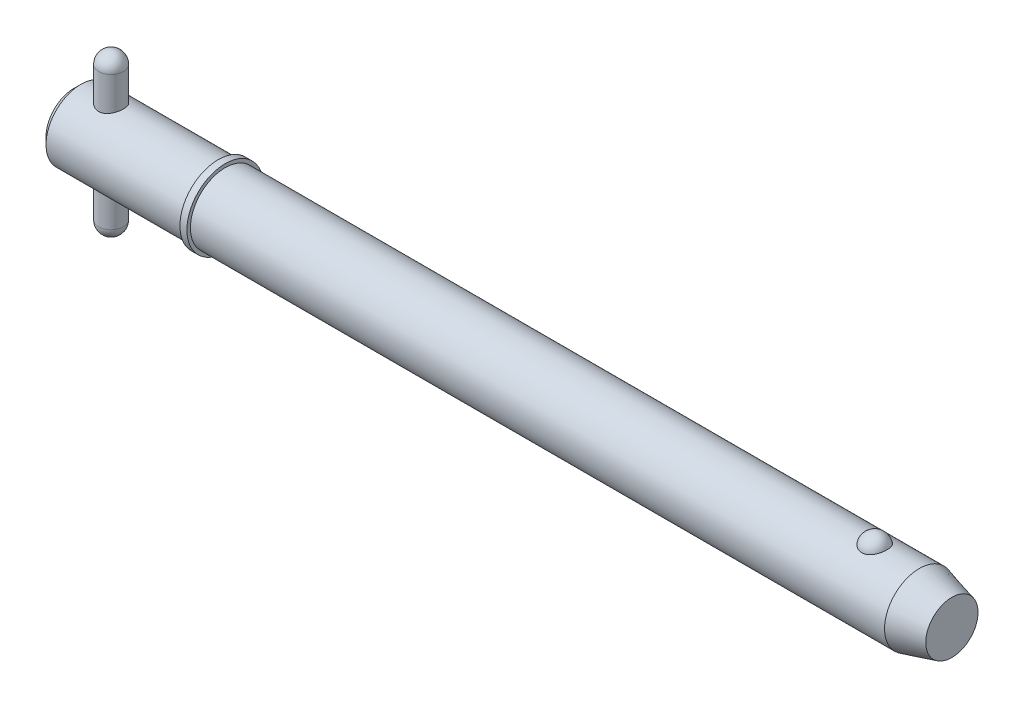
ISO-10303-21;
HEADER;
FILE_DESCRIPTION(('STEP AP214'),'2;1');
FILE_NAME('part.step','',(''),(''),'','','');
FILE_SCHEMA(('AUTOMOTIVE_DESIGN { 1 0 10303 214 1 1 1 1 }'));
ENDSEC;
DATA;
#1=APPLICATION_CONTEXT('core data for automotive mechanical design processes');
#2=APPLICATION_PROTOCOL_DEFINITION('international standard','automotive_design',2000,#1);
#3=PRODUCT_CONTEXT('',#1,'mechanical');
#4=PRODUCT('Part','Part','',(#3));
#5=PRODUCT_RELATED_PRODUCT_CATEGORY('part','',(#4));
#6=PRODUCT_DEFINITION_FORMATION('','',#4);
#7=PRODUCT_DEFINITION_CONTEXT('part definition',#1,'design');
#8=PRODUCT_DEFINITION('design','',#6,#7);
#9=PRODUCT_DEFINITION_SHAPE('','',#8);
#10=(LENGTH_UNIT() NAMED_UNIT(*) SI_UNIT(.MILLI.,.METRE.));
#11=(NAMED_UNIT(*) PLANE_ANGLE_UNIT() SI_UNIT($,.RADIAN.));
#12=(NAMED_UNIT(*) SI_UNIT($,.STERADIAN.) SOLID_ANGLE_UNIT());
#13=UNCERTAINTY_MEASURE_WITH_UNIT(LENGTH_MEASURE(1.E-05),#10,'distance_accuracy_value','');
#14=(GEOMETRIC_REPRESENTATION_CONTEXT(3) GLOBAL_UNCERTAINTY_ASSIGNED_CONTEXT((#13)) GLOBAL_UNIT_ASSIGNED_CONTEXT((#10,
#11,#12)) REPRESENTATION_CONTEXT('',''));
#15=CARTESIAN_POINT('',(0.,0.,0.));
#16=DIRECTION('',(0.,0.,1.));
#17=DIRECTION('',(1.,0.,0.));
#18=AXIS2_PLACEMENT_3D('',#15,#16,#17);
#19=CARTESIAN_POINT('',(5.94,12.7,0.));
#20=DIRECTION('',(0.,-1.,0.));
#21=DIRECTION('',(0.,0.,-1.));
#22=AXIS2_PLACEMENT_3D('',#19,#20,#21);
#23=CYLINDRICAL_SURFACE('',#22,1.98);
#24=CARTESIAN_POINT('',(5.94,-10.72,0.));
#25=DIRECTION('',(0.,-1.,0.));
#26=DIRECTION('',(0.,0.,-1.));
#27=AXIS2_PLACEMENT_3D('',#24,#25,#26);
#28=CIRCLE('',#27,1.98);
#29=CARTESIAN_POINT('',(5.94,-10.72,-1.98));
#30=VERTEX_POINT('',#29);
#31=EDGE_CURVE('P0_E10',#30,#30,#28,.F.);
#32=ORIENTED_EDGE('',*,*,#31,.T.);
#33=EDGE_LOOP('',(#32));
#34=FACE_BOUND('',#33,.T.);
#35=CARTESIAN_POINT('',(5.94,10.72,0.));
#36=DIRECTION('',(0.,-1.,0.));
#37=DIRECTION('',(0.,0.,-1.));
#38=AXIS2_PLACEMENT_3D('',#35,#36,#37);
#39=CIRCLE('',#38,1.98);
#40=CARTESIAN_POINT('',(5.94,10.72,-1.98));
#41=VERTEX_POINT('',#40);
#42=EDGE_CURVE('P0_E21',#41,#41,#39,.T.);
#43=ORIENTED_EDGE('',*,*,#42,.T.);
#44=EDGE_LOOP('',(#43));
#45=FACE_BOUND('',#44,.T.);
#46=ADVANCED_FACE('P0_F14',(#34,#45),#23,.T.);
#47=CARTESIAN_POINT('',(5.94,-10.72,0.));
#48=DIRECTION('',(0.,0.,1.));
#49=DIRECTION('',(1.,0.,0.));
#50=AXIS2_PLACEMENT_3D('',#47,#48,#49);
#51=SPHERICAL_SURFACE('',#50,1.98);
#52=CARTESIAN_POINT('',(5.94,-10.72,0.));
#53=DIRECTION('',(0.,-1.,0.));
#54=DIRECTION('',(0.,0.,-1.));
#55=AXIS2_PLACEMENT_3D('',#52,#53,#54);
#56=SPHERICAL_SURFACE('',#55,1.98);
#57=ORIENTED_EDGE('',*,*,#31,.F.);
#58=EDGE_LOOP('',(#57));
#59=FACE_BOUND('',#58,.T.);
#60=ADVANCED_FACE('P0_F29',(#59),#56,.T.);
#61=CARTESIAN_POINT('',(5.94,10.72,0.));
#62=DIRECTION('',(0.,0.,1.));
#63=DIRECTION('',(1.,0.,0.));
#64=AXIS2_PLACEMENT_3D('',#61,#62,#63);
#65=SPHERICAL_SURFACE('',#64,1.98);
#66=CARTESIAN_POINT('',(5.94,10.72,0.));
#67=DIRECTION('',(0.,-1.,0.));
#68=DIRECTION('',(0.,0.,-1.));
#69=AXIS2_PLACEMENT_3D('',#66,#67,#68);
#70=SPHERICAL_SURFACE('',#69,1.98);
#71=ORIENTED_EDGE('',*,*,#42,.F.);
#72=EDGE_LOOP('',(#71));
#73=FACE_BOUND('',#72,.T.);
#74=ADVANCED_FACE('P0_F16',(#73),#70,.T.);
#75=CLOSED_SHELL('',(#46,#60,#74));
#76=MANIFOLD_SOLID_BREP('P0_B1',#75);
#77=CARTESIAN_POINT('',(0.,0.,0.));
#78=DIRECTION('',(1.,0.,0.));
#79=DIRECTION('',(0.,0.,-1.));
#80=AXIS2_PLACEMENT_3D('',#77,#78,#79);
#81=CYLINDRICAL_SURFACE('',#80,5.555);
#82=CARTESIAN_POINT('',(134.817114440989,0.,0.));
#83=DIRECTION('',(1.,0.,0.));
#84=DIRECTION('',(0.,0.,-1.));
#85=AXIS2_PLACEMENT_3D('',#82,#83,#84);
#86=CIRCLE('',#85,5.555);
#87=CARTESIAN_POINT('',(134.817114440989,0.,-5.555));
#88=VERTEX_POINT('',#87);
#89=EDGE_CURVE('P1_E81',#88,#88,#86,.T.);
#90=ORIENTED_EDGE('',*,*,#89,.F.);
#91=EDGE_LOOP('',(#90));
#92=FACE_BOUND('',#91,.T.);
#93=CARTESIAN_POINT('',(24.13,0.,0.));
#94=DIRECTION('',(1.,0.,0.));
#95=DIRECTION('',(0.,0.,-1.));
#96=AXIS2_PLACEMENT_3D('',#93,#94,#95);
#97=CIRCLE('',#96,5.555);
#98=CARTESIAN_POINT('',(24.13,0.,-5.555));
#99=VERTEX_POINT('',#98);
#100=EDGE_CURVE('P1_E85',#99,#99,#97,.T.);
#101=ORIENTED_EDGE('',*,*,#100,.T.);
#102=EDGE_LOOP('',(#101));
#103=FACE_BOUND('',#102,.T.);
#104=CARTESIAN_POINT('',(127.698626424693,5.16741224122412,2.03859650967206));
#105=CARTESIAN_POINT('',(127.592949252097,5.16740893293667,2.03859990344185));
#106=CARTESIAN_POINT('',(127.48729894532,5.17079470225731,2.03008306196));
#107=CARTESIAN_POINT('',(127.279141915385,5.18392795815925,1.99630721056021));
#108=CARTESIAN_POINT('',(127.176634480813,5.19367399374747,1.97105201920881));
#109=CARTESIAN_POINT('',(126.977771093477,5.21839168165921,1.90463997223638));
#110=CARTESIAN_POINT('',(126.881406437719,5.23335573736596,1.86350622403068));
#111=CARTESIAN_POINT('',(126.697080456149,5.26688076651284,1.76652592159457));
#112=CARTESIAN_POINT('',(126.609120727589,5.28544242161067,1.71067657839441));
#113=CARTESIAN_POINT('',(126.441265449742,5.32479845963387,1.58399959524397));
#114=CARTESIAN_POINT('',(126.36166564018,5.34564089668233,1.51279545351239));
#115=CARTESIAN_POINT('',(126.21512901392,5.38697258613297,1.35828584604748));
#116=CARTESIAN_POINT('',(126.148194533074,5.40746177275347,1.27497815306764));
#117=CARTESIAN_POINT('',(126.02561039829,5.44694508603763,1.09440293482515));
#118=CARTESIAN_POINT('',(125.970598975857,5.46583143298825,0.99667783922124));
#119=CARTESIAN_POINT('',(125.876937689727,5.49908030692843,0.792961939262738));
#120=CARTESIAN_POINT('',(125.838289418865,5.513442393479,0.686970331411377));
#121=CARTESIAN_POINT('',(125.777680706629,5.536358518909,0.468019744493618));
#122=CARTESIAN_POINT('',(125.755972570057,5.54482455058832,0.354981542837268));
#123=CARTESIAN_POINT('',(125.730636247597,5.55473324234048,0.126595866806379));
#124=CARTESIAN_POINT('',(125.727007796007,5.55617600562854,0.011248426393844));
#125=CARTESIAN_POINT('',(125.737881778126,5.55189984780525,-0.218011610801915));
#126=CARTESIAN_POINT('',(125.752315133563,5.54620821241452,-0.331928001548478));
#127=CARTESIAN_POINT('',(125.798903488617,5.52828920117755,-0.555544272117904));
#128=CARTESIAN_POINT('',(125.831058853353,5.51606169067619,-0.665244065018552));
#129=CARTESIAN_POINT('',(125.912488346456,5.48630779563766,-0.877469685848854));
#130=CARTESIAN_POINT('',(125.961781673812,5.46877547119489,-0.979987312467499));
#131=CARTESIAN_POINT('',(126.076478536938,5.43024700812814,-1.17486975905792));
#132=CARTESIAN_POINT('',(126.141883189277,5.40925062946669,-1.26723387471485));
#133=CARTESIAN_POINT('',(126.287571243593,5.36600927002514,-1.43940133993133));
#134=CARTESIAN_POINT('',(126.367885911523,5.34376173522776,-1.51917763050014));
#135=CARTESIAN_POINT('',(126.541452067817,5.30057971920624,-1.66360338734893));
#136=CARTESIAN_POINT('',(126.634702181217,5.27964509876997,-1.72825445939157));
#137=CARTESIAN_POINT('',(126.829393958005,5.24205250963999,-1.83909478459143));
#138=CARTESIAN_POINT('',(126.930590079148,5.22530519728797,-1.88568407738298));
#139=CARTESIAN_POINT('',(127.140155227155,5.1975091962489,-1.9610080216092));
#140=CARTESIAN_POINT('',(127.248521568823,5.1864583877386,-1.98974931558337));
#141=CARTESIAN_POINT('',(127.463498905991,5.17184410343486,-2.0274226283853));
#142=CARTESIAN_POINT('',(127.569925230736,5.1679328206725,-2.03727608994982));
#143=CARTESIAN_POINT('',(127.782992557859,5.16698995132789,-2.03966777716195));
#144=CARTESIAN_POINT('',(127.889633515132,5.16995704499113,-2.03220932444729));
#145=CARTESIAN_POINT('',(128.096773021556,5.18222383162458,-2.00071170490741));
#146=CARTESIAN_POINT('',(128.197359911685,5.19133213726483,-1.97717337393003));
#147=CARTESIAN_POINT('',(128.393014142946,5.21467637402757,-1.91475248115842));
#148=CARTESIAN_POINT('',(128.488081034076,5.22891272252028,-1.87586867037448));
#149=CARTESIAN_POINT('',(128.672371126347,5.26137066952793,-1.78282713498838));
#150=CARTESIAN_POINT('',(128.761419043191,5.27967329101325,-1.7283512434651));
#151=CARTESIAN_POINT('',(128.929288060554,5.31817411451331,-1.60597483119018));
#152=CARTESIAN_POINT('',(129.008106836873,5.33837274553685,-1.53807126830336));
#153=CARTESIAN_POINT('',(129.157515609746,5.37968287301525,-1.38688970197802));
#154=CARTESIAN_POINT('',(129.227505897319,5.40079011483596,-1.30301744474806));
#155=CARTESIAN_POINT('',(129.353012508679,5.44074401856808,-1.1245817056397));
#156=CARTESIAN_POINT('',(129.408526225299,5.4595902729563,-1.03001630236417));
#157=CARTESIAN_POINT('',(129.505550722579,5.49369849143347,-0.829439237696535));
#158=CARTESIAN_POINT('',(129.54654838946,5.5088242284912,-0.72315564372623));
#159=CARTESIAN_POINT('',(129.611125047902,5.53310911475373,-0.504772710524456));
#160=CARTESIAN_POINT('',(129.634703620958,5.54226812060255,-0.392673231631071));
#161=CARTESIAN_POINT('',(129.664013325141,5.55370358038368,-0.165459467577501));
#162=CARTESIAN_POINT('',(129.669688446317,5.55595843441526,-0.050336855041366));
#163=CARTESIAN_POINT('',(129.662916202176,5.55329317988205,0.17928866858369));
#164=CARTESIAN_POINT('',(129.650469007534,5.54837313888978,0.293791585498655));
#165=CARTESIAN_POINT('',(129.607779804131,5.53189037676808,0.518526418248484));
#166=CARTESIAN_POINT('',(129.577598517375,5.5203503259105,0.628771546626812));
#167=CARTESIAN_POINT('',(129.500096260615,5.49182453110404,0.842318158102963));
#168=CARTESIAN_POINT('',(129.452774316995,5.47483847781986,0.945619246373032));
#169=CARTESIAN_POINT('',(129.341720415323,5.43710633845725,1.14281571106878));
#170=CARTESIAN_POINT('',(129.277921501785,5.41634501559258,1.23667048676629));
#171=CARTESIAN_POINT('',(129.135357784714,5.37334572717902,1.41185243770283));
#172=CARTESIAN_POINT('',(129.05659323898,5.35110778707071,1.49317982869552));
#173=CARTESIAN_POINT('',(128.886423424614,5.30779474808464,1.64049162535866));
#174=CARTESIAN_POINT('',(128.79510026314,5.28671324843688,1.70656877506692));
#175=CARTESIAN_POINT('',(128.601739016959,5.24804852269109,1.82201372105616));
#176=CARTESIAN_POINT('',(128.499700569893,5.23046541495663,1.87138095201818));
#177=CARTESIAN_POINT('',(128.283618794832,5.20042692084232,1.95335298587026));
#178=CARTESIAN_POINT('',(128.169260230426,5.18820192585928,1.98521734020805));
#179=CARTESIAN_POINT('',(127.936130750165,5.17169804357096,2.02783294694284));
#180=CARTESIAN_POINT('',(127.817361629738,5.16741595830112,2.03859269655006));
#181=CARTESIAN_POINT('',(127.698626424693,5.16741224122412,2.03859650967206));
#182=B_SPLINE_CURVE_WITH_KNOTS('',3,(#104,#105,#106,#107,#108,#109,#110,#111,#112,#113,#114,
#115,#116,#117,#118,#119,#120,#121,#122,#123,#124,#125,#126,#127,#128,#129,#130,#131,#132,#133,
#134,#135,#136,#137,#138,#139,#140,#141,#142,#143,#144,#145,#146,#147,#148,#149,#150,#151,#152,
#153,#154,#155,#156,#157,#158,#159,#160,#161,#162,#163,#164,#165,#166,#167,#168,#169,#170,#171,
#172,#173,#174,#175,#176,#177,#178,#179,#180,#181),.UNSPECIFIED.,.T.,.F.,(4,2,2,2,2,2,2,2,2,2,2,
2,2,2,2,2,2,2,2,2,2,2,2,2,2,2,2,2,2,2,2,2,2,2,2,2,2,2,4),(0.,0.316595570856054,
0.633118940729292,0.949183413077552,1.26530783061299,1.59030762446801,1.91536729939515,
2.25495824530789,2.59458224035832,2.93917283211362,3.28375835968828,3.6270300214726,
3.97030875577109,4.31397329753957,4.65766166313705,5.00207904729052,5.34645984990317,
5.68270547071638,6.01882587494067,6.33808403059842,6.65728093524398,6.966963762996,
7.27667180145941,7.59321535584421,7.90983070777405,8.24210387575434,8.57443684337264,
8.91755896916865,9.26068933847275,9.60489211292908,9.94909164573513,10.2921194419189,
10.6351667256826,10.9796305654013,11.3240884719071,11.6663928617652,12.0087088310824,
12.3645679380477,12.7202837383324),.UNSPECIFIED.);
#183=CARTESIAN_POINT('',(127.698626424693,5.16741224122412,2.03859650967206));
#184=VERTEX_POINT('',#183);
#185=EDGE_CURVE('P1_E35',#184,#184,#182,.T.);
#186=ORIENTED_EDGE('',*,*,#185,.T.);
#187=EDGE_LOOP('',(#186));
#188=FACE_BOUND('',#187,.T.);
#189=ADVANCED_FACE('P1_F13',(#92,#103,#188),#81,.T.);
#190=CARTESIAN_POINT('',(0.,0.,0.));
#191=DIRECTION('',(-1.,0.,0.));
#192=DIRECTION('',(0.,0.,1.));
#193=AXIS2_PLACEMENT_3D('',#190,#191,#192);
#194=PLANE('',#193);
#195=CARTESIAN_POINT('',(0.,0.,0.));
#196=DIRECTION('',(1.,0.,0.));
#197=DIRECTION('',(0.,0.,-1.));
#198=AXIS2_PLACEMENT_3D('',#195,#196,#197);
#199=CIRCLE('',#198,4.444);
#200=CARTESIAN_POINT('',(0.,0.,-4.444));
#201=VERTEX_POINT('',#200);
#202=EDGE_CURVE('P1_E9',#201,#201,#199,.T.);
#203=ORIENTED_EDGE('',*,*,#202,.F.);
#204=EDGE_LOOP('',(#203));
#205=FACE_BOUND('',#204,.T.);
#206=ADVANCED_FACE('P1_F15',(#205),#194,.T.);
#207=CARTESIAN_POINT('',(1.111,0.,0.));
#208=DIRECTION('',(1.,0.,0.));
#209=DIRECTION('',(0.,0.,-1.));
#210=AXIS2_PLACEMENT_3D('',#207,#208,#209);
#211=CONICAL_SURFACE('',#210,5.555,0.78539816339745);
#212=ORIENTED_EDGE('',*,*,#202,.T.);
#213=EDGE_LOOP('',(#212));
#214=FACE_BOUND('',#213,.T.);
#215=CARTESIAN_POINT('',(1.111,0.,0.));
#216=DIRECTION('',(1.,0.,0.));
#217=DIRECTION('',(0.,0.,-1.));
#218=AXIS2_PLACEMENT_3D('',#215,#216,#217);
#219=CIRCLE('',#218,5.555);
#220=CARTESIAN_POINT('',(1.111,0.,-5.555));
#221=VERTEX_POINT('',#220);
#222=EDGE_CURVE('P1_E26',#221,#221,#219,.T.);
#223=ORIENTED_EDGE('',*,*,#222,.F.);
#224=EDGE_LOOP('',(#223));
#225=FACE_BOUND('',#224,.T.);
#226=ADVANCED_FACE('P1_F77',(#214,#225),#211,.T.);
#227=CARTESIAN_POINT('',(0.,0.,0.));
#228=DIRECTION('',(1.,0.,0.));
#229=DIRECTION('',(0.,0.,-1.));
#230=AXIS2_PLACEMENT_3D('',#227,#228,#229);
#231=CYLINDRICAL_SURFACE('',#230,5.555);
#232=CARTESIAN_POINT('',(5.94,-5.19014691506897,1.98));
#233=CARTESIAN_POINT('',(5.83264687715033,-5.19014494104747,1.98000226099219));
#234=CARTESIAN_POINT('',(5.7253094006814,-5.19351395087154,1.97123988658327));
#235=CARTESIAN_POINT('',(5.51384517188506,-5.20654291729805,1.93656219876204));
#236=CARTESIAN_POINT('',(5.40971858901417,-5.21620320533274,1.91064598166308));
#237=CARTESIAN_POINT('',(5.20778082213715,-5.24058443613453,1.84271148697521));
#238=CARTESIAN_POINT('',(5.10995634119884,-5.25529427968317,1.80072850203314));
#239=CARTESIAN_POINT('',(4.92270352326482,-5.28810012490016,1.70197537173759));
#240=CARTESIAN_POINT('',(4.83327743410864,-5.3061970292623,1.64520128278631));
#241=CARTESIAN_POINT('',(4.66135184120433,-5.34464714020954,1.51575187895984));
#242=CARTESIAN_POINT('',(4.57928277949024,-5.36506222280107,1.44252311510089));
#243=CARTESIAN_POINT('',(4.42829115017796,-5.40532920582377,1.28342047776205));
#244=CARTESIAN_POINT('',(4.35937105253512,-5.42518099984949,1.19754423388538));
#245=CARTESIAN_POINT('',(4.23461605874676,-5.46281133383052,1.01237205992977));
#246=CARTESIAN_POINT('',(4.17924129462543,-5.48050875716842,0.912748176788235));
#247=CARTESIAN_POINT('',(4.0862117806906,-5.51109938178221,0.70485824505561));
#248=CARTESIAN_POINT('',(4.0485515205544,-5.52399407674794,0.596594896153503));
#249=CARTESIAN_POINT('',(3.99350662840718,-5.54308759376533,0.379019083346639));
#250=CARTESIAN_POINT('',(3.97538263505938,-5.54952987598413,0.269915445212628));
#251=CARTESIAN_POINT('',(3.95756405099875,-5.55586205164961,0.0500378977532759));
#252=CARTESIAN_POINT('',(3.95786404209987,-5.55575387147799,-0.060735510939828));
#253=CARTESIAN_POINT('',(3.97643665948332,-5.54915684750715,-0.275539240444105));
#254=CARTESIAN_POINT('',(3.99390415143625,-5.54295384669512,-0.379649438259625));
#255=CARTESIAN_POINT('',(4.0449721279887,-5.52523170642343,-0.583350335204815));
#256=CARTESIAN_POINT('',(4.07857373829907,-5.51371219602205,-0.682940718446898));
#257=CARTESIAN_POINT('',(4.16137312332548,-5.4863099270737,-0.876423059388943));
#258=CARTESIAN_POINT('',(4.2107826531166,-5.47036834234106,-0.970215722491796));
#259=CARTESIAN_POINT('',(4.32361427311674,-5.43575653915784,-1.1484017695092));
#260=CARTESIAN_POINT('',(4.38704062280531,-5.41708549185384,-1.23279228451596));
#261=CARTESIAN_POINT('',(4.53006791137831,-5.37778429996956,-1.39454579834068));
#262=CARTESIAN_POINT('',(4.61035105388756,-5.35710277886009,-1.4712940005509));
#263=CARTESIAN_POINT('',(4.78279835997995,-5.31692766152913,-1.6104545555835));
#264=CARTESIAN_POINT('',(4.874964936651,-5.29743430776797,-1.67286398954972));
#265=CARTESIAN_POINT('',(5.07076688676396,-5.26153775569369,-1.78259698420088));
#266=CARTESIAN_POINT('',(5.17458163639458,-5.24519780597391,-1.8296227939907));
#267=CARTESIAN_POINT('',(5.38938990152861,-5.21818744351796,-1.90530278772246));
#268=CARTESIAN_POINT('',(5.50037985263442,-5.20751423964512,-1.93396601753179));
#269=CARTESIAN_POINT('',(5.72036376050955,-5.19369176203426,-1.97077654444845));
#270=CARTESIAN_POINT('',(5.82917370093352,-5.19018851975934,-1.97989015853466));
#271=CARTESIAN_POINT('',(6.04680100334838,-5.19010609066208,-1.98010779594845));
#272=CARTESIAN_POINT('',(6.15561835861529,-5.19352540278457,-1.97121572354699));
#273=CARTESIAN_POINT('',(6.36548036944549,-5.20654623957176,-1.93654727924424));
#274=CARTESIAN_POINT('',(6.46666051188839,-5.21588705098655,-1.91148218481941));
#275=CARTESIAN_POINT('',(6.66334537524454,-5.23939939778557,-1.84605494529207));
#276=CARTESIAN_POINT('',(6.75884899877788,-5.25357186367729,-1.8056898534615));
#277=CARTESIAN_POINT('',(6.94517989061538,-5.28576258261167,-1.70921153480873));
#278=CARTESIAN_POINT('',(7.03572661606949,-5.30389804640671,-1.65259670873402));
#279=CARTESIAN_POINT('',(7.20638087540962,-5.34176077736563,-1.52577523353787));
#280=CARTESIAN_POINT('',(7.28648490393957,-5.36148857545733,-1.45556404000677));
#281=CARTESIAN_POINT('',(7.43864697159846,-5.40165494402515,-1.2988614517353));
#282=CARTESIAN_POINT('',(7.50999887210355,-5.42207106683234,-1.21167640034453));
#283=CARTESIAN_POINT('',(7.63712639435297,-5.46023601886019,-1.026066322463));
#284=CARTESIAN_POINT('',(7.69290228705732,-5.47798489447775,-0.927641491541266));
#285=CARTESIAN_POINT('',(7.78684673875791,-5.50876590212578,-0.722633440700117));
#286=CARTESIAN_POINT('',(7.82510508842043,-5.52182201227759,-0.616095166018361));
#287=CARTESIAN_POINT('',(7.88297051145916,-5.54184206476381,-0.397530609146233));
#288=CARTESIAN_POINT('',(7.90258540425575,-5.5488085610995,-0.285506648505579));
#289=CARTESIAN_POINT('',(7.9218262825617,-5.55564472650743,-0.065566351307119));
#290=CARTESIAN_POINT('',(7.92245987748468,-5.55587212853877,0.0422515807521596));
#291=CARTESIAN_POINT('',(7.90626329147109,-5.55011340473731,0.256387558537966));
#292=CARTESIAN_POINT('',(7.88943488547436,-5.54412791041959,0.362705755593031));
#293=CARTESIAN_POINT('',(7.83948457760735,-5.52676548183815,0.568649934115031));
#294=CARTESIAN_POINT('',(7.8067003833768,-5.51550046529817,0.668367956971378));
#295=CARTESIAN_POINT('',(7.72609369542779,-5.48874437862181,0.860911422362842));
#296=CARTESIAN_POINT('',(7.67826838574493,-5.47325251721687,0.953735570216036));
#297=CARTESIAN_POINT('',(7.56675024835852,-5.43884382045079,1.13391068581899));
#298=CARTESIAN_POINT('',(7.50249968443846,-5.41981485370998,1.22089468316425));
#299=CARTESIAN_POINT('',(7.36086495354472,-5.38069275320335,1.38316665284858));
#300=CARTESIAN_POINT('',(7.28347630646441,-5.36059925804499,1.45845061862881));
#301=CARTESIAN_POINT('',(7.11347587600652,-5.32048380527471,1.59876646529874));
#302=CARTESIAN_POINT('',(7.02032386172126,-5.30050854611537,1.66315951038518));
#303=CARTESIAN_POINT('',(6.82388804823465,-5.26398994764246,1.77536801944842));
#304=CARTESIAN_POINT('',(6.7206049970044,-5.24744635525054,1.82318470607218));
#305=CARTESIAN_POINT('',(6.50639706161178,-5.21987969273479,1.90068230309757));
#306=CARTESIAN_POINT('',(6.3954529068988,-5.20887116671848,1.93031547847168));
#307=CARTESIAN_POINT('',(6.16966522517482,-5.19400760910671,1.96996824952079));
#308=CARTESIAN_POINT('',(6.05482366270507,-5.19014902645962,1.97999758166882));
#309=CARTESIAN_POINT('',(5.94,-5.19014691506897,1.98));
#310=B_SPLINE_CURVE_WITH_KNOTS('',3,(#232,#233,#234,#235,#236,#237,#238,#239,#240,#241,#242,
#243,#244,#245,#246,#247,#248,#249,#250,#251,#252,#253,#254,#255,#256,#257,#258,#259,#260,#261,
#262,#263,#264,#265,#266,#267,#268,#269,#270,#271,#272,#273,#274,#275,#276,#277,#278,#279,#280,
#281,#282,#283,#284,#285,#286,#287,#288,#289,#290,#291,#292,#293,#294,#295,#296,#297,#298,#299,
#300,#301,#302,#303,#304,#305,#306,#307,#308,#309),.UNSPECIFIED.,.T.,.F.,(4,2,2,2,2,2,2,2,2,2,2,
2,2,2,2,2,2,2,2,2,2,2,2,2,2,2,2,2,2,2,2,2,2,2,2,2,2,2,4),(0.,0.321632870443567,
0.643282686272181,0.964229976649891,1.28526292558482,1.61937087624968,1.9535415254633,
2.29784481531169,2.64204093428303,2.97269632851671,3.30325448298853,3.61901541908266,
3.93479838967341,4.25500220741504,4.57530346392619,4.91268648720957,5.25013812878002,
5.59378026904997,5.93725299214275,6.26331481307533,6.58930593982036,6.90185604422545,
7.21446637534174,7.53801472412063,7.86167140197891,8.20353561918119,8.54539388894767,
8.88547970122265,9.22542281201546,9.54728637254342,9.86911722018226,10.1844146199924,
10.4997710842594,10.827730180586,11.1558013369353,11.499115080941,11.8424034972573,
12.1865892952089,12.5306041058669),.UNSPECIFIED.);
#311=CARTESIAN_POINT('',(5.94,-5.19014691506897,1.98));
#312=VERTEX_POINT('',#311);
#313=EDGE_CURVE('P1_E17',#312,#312,#310,.T.);
#314=ORIENTED_EDGE('',*,*,#313,.F.);
#315=EDGE_LOOP('',(#314));
#316=FACE_BOUND('',#315,.T.);
#317=CARTESIAN_POINT('',(5.94,5.19014691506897,1.98));
#318=CARTESIAN_POINT('',(6.04735312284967,5.19014494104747,1.98000226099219));
#319=CARTESIAN_POINT('',(6.1546905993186,5.19351395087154,1.97123988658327));
#320=CARTESIAN_POINT('',(6.36615482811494,5.20654291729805,1.93656219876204));
#321=CARTESIAN_POINT('',(6.47028141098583,5.21620320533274,1.91064598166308));
#322=CARTESIAN_POINT('',(6.67221917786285,5.24058443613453,1.84271148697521));
#323=CARTESIAN_POINT('',(6.77004365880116,5.25529427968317,1.80072850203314));
#324=CARTESIAN_POINT('',(6.95729647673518,5.28810012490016,1.70197537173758));
#325=CARTESIAN_POINT('',(7.04672256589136,5.3061970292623,1.64520128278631));
#326=CARTESIAN_POINT('',(7.21864815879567,5.34464714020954,1.51575187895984));
#327=CARTESIAN_POINT('',(7.30071722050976,5.36506222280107,1.44252311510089));
#328=CARTESIAN_POINT('',(7.45170884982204,5.40532920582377,1.28342047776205));
#329=CARTESIAN_POINT('',(7.52062894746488,5.42518099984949,1.19754423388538));
#330=CARTESIAN_POINT('',(7.64538394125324,5.46281133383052,1.01237205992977));
#331=CARTESIAN_POINT('',(7.70075870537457,5.48050875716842,0.912748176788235));
#332=CARTESIAN_POINT('',(7.7937882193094,5.51109938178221,0.704858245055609));
#333=CARTESIAN_POINT('',(7.8314484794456,5.52399407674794,0.596594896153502));
#334=CARTESIAN_POINT('',(7.88649337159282,5.54308759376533,0.379019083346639));
#335=CARTESIAN_POINT('',(7.90461736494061,5.54952987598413,0.269915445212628));
#336=CARTESIAN_POINT('',(7.92243594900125,5.55586205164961,0.0500378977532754));
#337=CARTESIAN_POINT('',(7.92213595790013,5.55575387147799,-0.0607355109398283));
#338=CARTESIAN_POINT('',(7.90356334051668,5.54915684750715,-0.275539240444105));
#339=CARTESIAN_POINT('',(7.88609584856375,5.54295384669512,-0.379649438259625));
#340=CARTESIAN_POINT('',(7.8350278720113,5.52523170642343,-0.583350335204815));
#341=CARTESIAN_POINT('',(7.80142626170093,5.51371219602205,-0.682940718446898));
#342=CARTESIAN_POINT('',(7.71862687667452,5.4863099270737,-0.876423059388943));
#343=CARTESIAN_POINT('',(7.6692173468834,5.47036834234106,-0.970215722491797));
#344=CARTESIAN_POINT('',(7.55638572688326,5.43575653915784,-1.1484017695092));
#345=CARTESIAN_POINT('',(7.49295937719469,5.41708549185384,-1.23279228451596));
#346=CARTESIAN_POINT('',(7.34993208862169,5.37778429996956,-1.39454579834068));
#347=CARTESIAN_POINT('',(7.26964894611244,5.35710277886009,-1.4712940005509));
#348=CARTESIAN_POINT('',(7.09720164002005,5.31692766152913,-1.6104545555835));
#349=CARTESIAN_POINT('',(7.00503506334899,5.29743430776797,-1.67286398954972));
#350=CARTESIAN_POINT('',(6.80923311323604,5.26153775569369,-1.78259698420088));
#351=CARTESIAN_POINT('',(6.70541836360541,5.24519780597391,-1.8296227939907));
#352=CARTESIAN_POINT('',(6.49061009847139,5.21818744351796,-1.90530278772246));
#353=CARTESIAN_POINT('',(6.37962014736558,5.20751423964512,-1.93396601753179));
#354=CARTESIAN_POINT('',(6.15963623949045,5.19369176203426,-1.97077654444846));
#355=CARTESIAN_POINT('',(6.05082629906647,5.19018851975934,-1.97989015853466));
#356=CARTESIAN_POINT('',(5.83319899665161,5.19010609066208,-1.98010779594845));
#357=CARTESIAN_POINT('',(5.7243816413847,5.19352540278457,-1.97121572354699));
#358=CARTESIAN_POINT('',(5.5145196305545,5.20654623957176,-1.93654727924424));
#359=CARTESIAN_POINT('',(5.4133394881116,5.21588705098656,-1.91148218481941));
#360=CARTESIAN_POINT('',(5.21665462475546,5.23939939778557,-1.84605494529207));
#361=CARTESIAN_POINT('',(5.12115100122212,5.25357186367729,-1.8056898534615));
#362=CARTESIAN_POINT('',(4.93482010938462,5.28576258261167,-1.70921153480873));
#363=CARTESIAN_POINT('',(4.84427338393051,5.30389804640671,-1.65259670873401));
#364=CARTESIAN_POINT('',(4.67361912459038,5.34176077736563,-1.52577523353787));
#365=CARTESIAN_POINT('',(4.59351509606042,5.36148857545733,-1.45556404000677));
#366=CARTESIAN_POINT('',(4.44135302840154,5.40165494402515,-1.2988614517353));
#367=CARTESIAN_POINT('',(4.37000112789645,5.42207106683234,-1.21167640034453));
#368=CARTESIAN_POINT('',(4.24287360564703,5.46023601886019,-1.026066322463));
#369=CARTESIAN_POINT('',(4.18709771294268,5.47798489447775,-0.927641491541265));
#370=CARTESIAN_POINT('',(4.09315326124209,5.50876590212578,-0.722633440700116));
#371=CARTESIAN_POINT('',(4.05489491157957,5.52182201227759,-0.61609516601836));
#372=CARTESIAN_POINT('',(3.99702948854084,5.54184206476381,-0.397530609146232));
#373=CARTESIAN_POINT('',(3.97741459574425,5.5488085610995,-0.285506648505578));
#374=CARTESIAN_POINT('',(3.9581737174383,5.55564472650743,-0.0655663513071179));
#375=CARTESIAN_POINT('',(3.95754012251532,5.55587212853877,0.0422515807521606));
#376=CARTESIAN_POINT('',(3.97373670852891,5.55011340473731,0.256387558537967));
#377=CARTESIAN_POINT('',(3.99056511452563,5.54412791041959,0.362705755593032));
#378=CARTESIAN_POINT('',(4.04051542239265,5.52676548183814,0.568649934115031));
#379=CARTESIAN_POINT('',(4.07329961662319,5.51550046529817,0.668367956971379));
#380=CARTESIAN_POINT('',(4.15390630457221,5.48874437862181,0.860911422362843));
#381=CARTESIAN_POINT('',(4.20173161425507,5.47325251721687,0.953735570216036));
#382=CARTESIAN_POINT('',(4.31324975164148,5.43884382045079,1.13391068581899));
#383=CARTESIAN_POINT('',(4.37750031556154,5.41981485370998,1.22089468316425));
#384=CARTESIAN_POINT('',(4.51913504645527,5.38069275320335,1.38316665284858));
#385=CARTESIAN_POINT('',(4.59652369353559,5.36059925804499,1.45845061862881));
#386=CARTESIAN_POINT('',(4.76652412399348,5.32048380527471,1.59876646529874));
#387=CARTESIAN_POINT('',(4.85967613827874,5.30050854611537,1.66315951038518));
#388=CARTESIAN_POINT('',(5.05611195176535,5.26398994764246,1.77536801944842));
#389=CARTESIAN_POINT('',(5.1593950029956,5.24744635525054,1.82318470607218));
#390=CARTESIAN_POINT('',(5.37360293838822,5.21987969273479,1.90068230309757));
#391=CARTESIAN_POINT('',(5.4845470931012,5.20887116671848,1.93031547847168));
#392=CARTESIAN_POINT('',(5.71033477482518,5.19400760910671,1.96996824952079));
#393=CARTESIAN_POINT('',(5.82517633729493,5.19014902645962,1.97999758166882));
#394=CARTESIAN_POINT('',(5.94,5.19014691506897,1.98));
#395=B_SPLINE_CURVE_WITH_KNOTS('',3,(#317,#318,#319,#320,#321,#322,#323,#324,#325,#326,#327,
#328,#329,#330,#331,#332,#333,#334,#335,#336,#337,#338,#339,#340,#341,#342,#343,#344,#345,#346,
#347,#348,#349,#350,#351,#352,#353,#354,#355,#356,#357,#358,#359,#360,#361,#362,#363,#364,#365,
#366,#367,#368,#369,#370,#371,#372,#373,#374,#375,#376,#377,#378,#379,#380,#381,#382,#383,#384,
#385,#386,#387,#388,#389,#390,#391,#392,#393,#394),.UNSPECIFIED.,.T.,.F.,(4,2,2,2,2,2,2,2,2,2,2,
2,2,2,2,2,2,2,2,2,2,2,2,2,2,2,2,2,2,2,2,2,2,2,2,2,2,2,4),(0.,0.321632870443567,
0.643282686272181,0.964229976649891,1.28526292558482,1.61937087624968,1.9535415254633,
2.29784481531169,2.64204093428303,2.97269632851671,3.30325448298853,3.61901541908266,
3.93479838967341,4.25500220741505,4.57530346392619,4.91268648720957,5.25013812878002,
5.59378026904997,5.93725299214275,6.26331481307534,6.58930593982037,6.90185604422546,
7.21446637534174,7.53801472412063,7.86167140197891,8.20353561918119,8.54539388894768,
8.88547970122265,9.22542281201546,9.54728637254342,9.86911722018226,10.1844146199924,
10.4997710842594,10.827730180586,11.1558013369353,11.499115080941,11.8424034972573,
12.1865892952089,12.5306041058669),.UNSPECIFIED.);
#396=CARTESIAN_POINT('',(5.94,5.19014691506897,1.98));
#397=VERTEX_POINT('',#396);
#398=EDGE_CURVE('P1_E43',#397,#397,#395,.T.);
#399=ORIENTED_EDGE('',*,*,#398,.F.);
#400=EDGE_LOOP('',(#399));
#401=FACE_BOUND('',#400,.T.);
#402=ORIENTED_EDGE('',*,*,#222,.T.);
#403=EDGE_LOOP('',(#402));
#404=FACE_BOUND('',#403,.T.);
#405=CARTESIAN_POINT('',(23.019,0.,0.));
#406=DIRECTION('',(1.,0.,0.));
#407=DIRECTION('',(0.,0.,-1.));
#408=AXIS2_PLACEMENT_3D('',#405,#406,#407);
#409=CIRCLE('',#408,5.555);
#410=CARTESIAN_POINT('',(23.019,0.,-5.555));
#411=VERTEX_POINT('',#410);
#412=EDGE_CURVE('P1_E31',#411,#411,#409,.T.);
#413=ORIENTED_EDGE('',*,*,#412,.F.);
#414=EDGE_LOOP('',(#413));
#415=FACE_BOUND('',#414,.T.);
#416=ADVANCED_FACE('P1_F103',(#316,#401,#404,#415),#231,.T.);
#417=CARTESIAN_POINT('',(23.019,5.555,0.));
#418=DIRECTION('',(-1.,0.,0.));
#419=DIRECTION('',(0.,0.,1.));
#420=AXIS2_PLACEMENT_3D('',#417,#418,#419);
#421=PLANE('',#420);
#422=ORIENTED_EDGE('',*,*,#412,.T.);
#423=EDGE_LOOP('',(#422));
#424=FACE_BOUND('',#423,.T.);
#425=CARTESIAN_POINT('',(23.019,0.,0.));
#426=DIRECTION('',(1.,0.,0.));
#427=DIRECTION('',(0.,0.,-1.));
#428=AXIS2_PLACEMENT_3D('',#425,#426,#427);
#429=CIRCLE('',#428,6.1105);
#430=CARTESIAN_POINT('',(23.019,0.,-6.1105));
#431=VERTEX_POINT('',#430);
#432=EDGE_CURVE('P1_E91',#431,#431,#429,.T.);
#433=ORIENTED_EDGE('',*,*,#432,.F.);
#434=EDGE_LOOP('',(#433));
#435=FACE_BOUND('',#434,.T.);
#436=ADVANCED_FACE('P1_F100',(#424,#435),#421,.T.);
#437=CARTESIAN_POINT('',(0.,0.,0.));
#438=DIRECTION('',(1.,0.,0.));
#439=DIRECTION('',(0.,0.,-1.));
#440=AXIS2_PLACEMENT_3D('',#437,#438,#439);
#441=CYLINDRICAL_SURFACE('',#440,6.1105);
#442=ORIENTED_EDGE('',*,*,#432,.T.);
#443=EDGE_LOOP('',(#442));
#444=FACE_BOUND('',#443,.T.);
#445=CARTESIAN_POINT('',(24.13,0.,0.));
#446=DIRECTION('',(1.,0.,0.));
#447=DIRECTION('',(0.,0.,-1.));
#448=AXIS2_PLACEMENT_3D('',#445,#446,#447);
#449=CIRCLE('',#448,6.1105);
#450=CARTESIAN_POINT('',(24.13,0.,-6.1105));
#451=VERTEX_POINT('',#450);
#452=EDGE_CURVE('P1_E88',#451,#451,#449,.T.);
#453=ORIENTED_EDGE('',*,*,#452,.F.);
#454=EDGE_LOOP('',(#453));
#455=FACE_BOUND('',#454,.T.);
#456=ADVANCED_FACE('P1_F68',(#444,#455),#441,.T.);
#457=CARTESIAN_POINT('',(24.13,6.1105,0.));
#458=DIRECTION('',(1.,0.,0.));
#459=DIRECTION('',(0.,0.,-1.));
#460=AXIS2_PLACEMENT_3D('',#457,#458,#459);
#461=PLANE('',#460);
#462=ORIENTED_EDGE('',*,*,#452,.T.);
#463=EDGE_LOOP('',(#462));
#464=FACE_BOUND('',#463,.T.);
#465=ORIENTED_EDGE('',*,*,#100,.F.);
#466=EDGE_LOOP('',(#465));
#467=FACE_BOUND('',#466,.T.);
#468=ADVANCED_FACE('P1_F62',(#464,#467),#461,.T.);
#469=CARTESIAN_POINT('',(140.,0.,0.));
#470=DIRECTION('',(-1.,0.,0.));
#471=DIRECTION('',(0.,0.,1.));
#472=AXIS2_PLACEMENT_3D('',#469,#470,#471);
#473=CONICAL_SURFACE('',#472,4.16625000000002,0.26179938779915);
#474=ORIENTED_EDGE('',*,*,#89,.T.);
#475=EDGE_LOOP('',(#474));
#476=FACE_BOUND('',#475,.T.);
#477=CARTESIAN_POINT('',(140.,0.,0.));
#478=DIRECTION('',(1.,0.,0.));
#479=DIRECTION('',(0.,0.,-1.));
#480=AXIS2_PLACEMENT_3D('',#477,#478,#479);
#481=CIRCLE('',#480,4.16625000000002);
#482=CARTESIAN_POINT('',(140.,0.,-4.16625000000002));
#483=VERTEX_POINT('',#482);
#484=EDGE_CURVE('P1_E42',#483,#483,#481,.T.);
#485=ORIENTED_EDGE('',*,*,#484,.F.);
#486=EDGE_LOOP('',(#485));
#487=FACE_BOUND('',#486,.T.);
#488=ADVANCED_FACE('P1_F59',(#476,#487),#473,.T.);
#489=CARTESIAN_POINT('',(140.,4.16625000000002,0.));
#490=DIRECTION('',(1.,0.,0.));
#491=DIRECTION('',(0.,0.,-1.));
#492=AXIS2_PLACEMENT_3D('',#489,#490,#491);
#493=PLANE('',#492);
#494=ORIENTED_EDGE('',*,*,#484,.T.);
#495=EDGE_LOOP('',(#494));
#496=FACE_BOUND('',#495,.T.);
#497=ADVANCED_FACE('P1_F55',(#496),#493,.T.);
#498=CARTESIAN_POINT('',(127.698626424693,4.9995,0.));
#499=DIRECTION('',(-1.,0.,0.));
#500=DIRECTION('',(0.,1.,0.));
#501=AXIS2_PLACEMENT_3D('',#498,#499,#500);
#502=SPHERICAL_SURFACE('',#501,2.04550000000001);
#503=ORIENTED_EDGE('',*,*,#185,.F.);
#504=EDGE_LOOP('',(#503));
#505=FACE_BOUND('',#504,.T.);
#506=ADVANCED_FACE('P1_F50',(#505),#502,.T.);
#507=CARTESIAN_POINT('',(5.94,-6.1105,0.));
#508=DIRECTION('',(0.,1.,0.));
#509=DIRECTION('',(0.,0.,1.));
#510=AXIS2_PLACEMENT_3D('',#507,#508,#509);
#511=CYLINDRICAL_SURFACE('',#510,1.98);
#512=ORIENTED_EDGE('',*,*,#313,.T.);
#513=EDGE_LOOP('',(#512));
#514=FACE_BOUND('',#513,.T.);
#515=ORIENTED_EDGE('',*,*,#398,.T.);
#516=EDGE_LOOP('',(#515));
#517=FACE_BOUND('',#516,.T.);
#518=ADVANCED_FACE('P1_F54',(#514,#517),#511,.F.);
#519=CLOSED_SHELL('',(#189,#206,#226,#416,#436,#456,#468,#488,#497,#506,#518));
#520=MANIFOLD_SOLID_BREP('P1_B1',#519);
#521=ADVANCED_BREP_SHAPE_REPRESENTATION('',(#18,#76,#520),#14);
#522=SHAPE_DEFINITION_REPRESENTATION(#9,#521);
ENDSEC;
END-ISO-10303-21;
